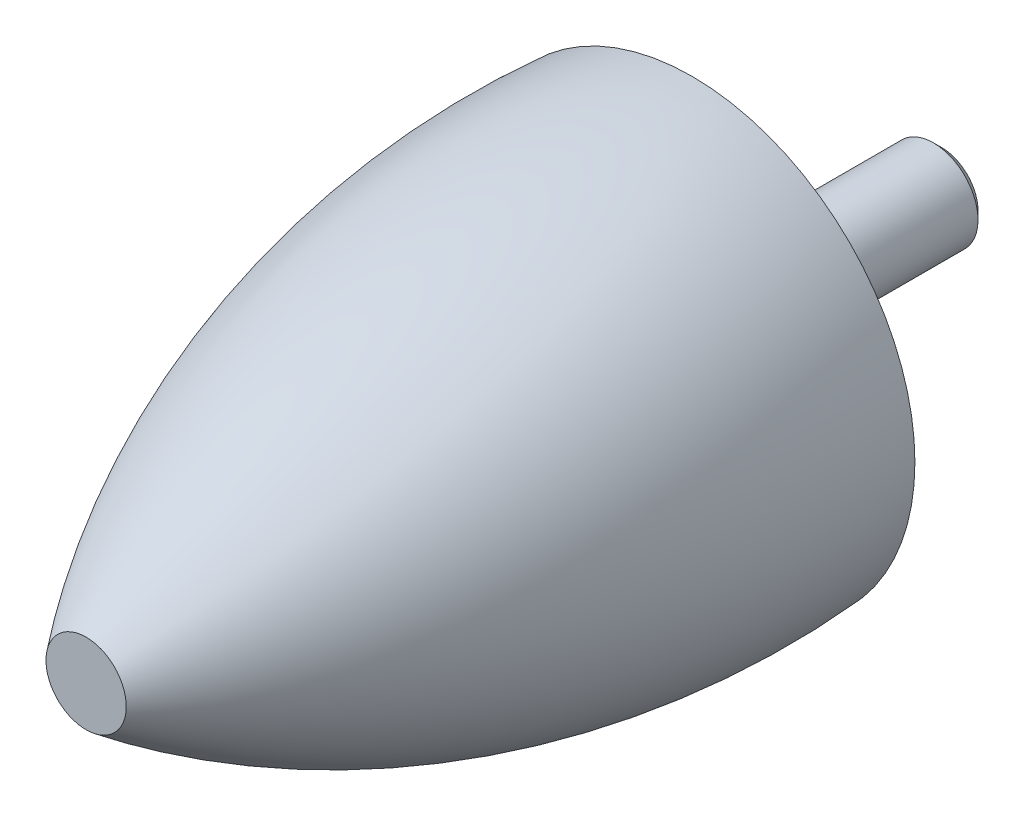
ISO-10303-21;
HEADER;
FILE_DESCRIPTION(('STEP AP214'),'2;1');
FILE_NAME('part.step','',(''),(''),'','','');
FILE_SCHEMA(('AUTOMOTIVE_DESIGN { 1 0 10303 214 1 1 1 1 }'));
ENDSEC;
DATA;
#1=APPLICATION_CONTEXT('core data for automotive mechanical design processes');
#2=APPLICATION_PROTOCOL_DEFINITION('international standard','automotive_design',2000,#1);
#3=PRODUCT_CONTEXT('',#1,'mechanical');
#4=PRODUCT('Part','Part','',(#3));
#5=PRODUCT_RELATED_PRODUCT_CATEGORY('part','',(#4));
#6=PRODUCT_DEFINITION_FORMATION('','',#4);
#7=PRODUCT_DEFINITION_CONTEXT('part definition',#1,'design');
#8=PRODUCT_DEFINITION('design','',#6,#7);
#9=PRODUCT_DEFINITION_SHAPE('','',#8);
#10=(LENGTH_UNIT() NAMED_UNIT(*) SI_UNIT(.MILLI.,.METRE.));
#11=(NAMED_UNIT(*) PLANE_ANGLE_UNIT() SI_UNIT($,.RADIAN.));
#12=(NAMED_UNIT(*) SI_UNIT($,.STERADIAN.) SOLID_ANGLE_UNIT());
#13=UNCERTAINTY_MEASURE_WITH_UNIT(LENGTH_MEASURE(1.E-05),#10,'distance_accuracy_value','');
#14=(GEOMETRIC_REPRESENTATION_CONTEXT(3) GLOBAL_UNCERTAINTY_ASSIGNED_CONTEXT((#13)) GLOBAL_UNIT_ASSIGNED_CONTEXT((#10,
#11,#12)) REPRESENTATION_CONTEXT('',''));
#15=CARTESIAN_POINT('',(0.,0.,0.));
#16=DIRECTION('',(0.,0.,1.));
#17=DIRECTION('',(1.,0.,0.));
#18=AXIS2_PLACEMENT_3D('',#15,#16,#17);
#19=CARTESIAN_POINT('',(25.,0.,0.));
#20=DIRECTION('',(0.,0.,1.));
#21=DIRECTION('',(0.,-1.,0.));
#22=AXIS2_PLACEMENT_3D('',#19,#20,#21);
#23=PLANE('',#22);
#24=CARTESIAN_POINT('',(0.,0.,0.));
#25=DIRECTION('',(0.,0.,-1.));
#26=DIRECTION('',(0.,1.,0.));
#27=AXIS2_PLACEMENT_3D('',#24,#25,#26);
#28=CIRCLE('',#27,5.);
#29=CARTESIAN_POINT('',(0.,5.,0.));
#30=VERTEX_POINT('',#29);
#31=EDGE_CURVE('E23',#30,#30,#28,.T.);
#32=ORIENTED_EDGE('',*,*,#31,.F.);
#33=EDGE_LOOP('',(#32));
#34=FACE_BOUND('',#33,.T.);
#35=CARTESIAN_POINT('',(0.,0.,-1.6826817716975E-13));
#36=DIRECTION('',(0.,0.,-1.));
#37=DIRECTION('',(0.,1.,0.));
#38=AXIS2_PLACEMENT_3D('',#35,#36,#37);
#39=CIRCLE('',#38,25.);
#40=CARTESIAN_POINT('',(0.,25.,-1.6826817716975E-13));
#41=VERTEX_POINT('',#40);
#42=EDGE_CURVE('E19',#41,#41,#39,.T.);
#43=ORIENTED_EDGE('',*,*,#42,.T.);
#44=EDGE_LOOP('',(#43));
#45=FACE_BOUND('',#44,.T.);
#46=ADVANCED_FACE('F12',(#34,#45),#23,.F.);
#47=CARTESIAN_POINT('',(0.,0.,68.));
#48=DIRECTION('',(0.,0.,-1.));
#49=DIRECTION('',(0.,1.,0.));
#50=AXIS2_PLACEMENT_3D('',#47,#48,#49);
#51=PLANE('',#50);
#52=CARTESIAN_POINT('',(0.,0.,68.));
#53=DIRECTION('',(0.,0.,-1.));
#54=DIRECTION('',(0.,1.,0.));
#55=AXIS2_PLACEMENT_3D('',#52,#53,#54);
#56=CIRCLE('',#55,4.5045045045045);
#57=CARTESIAN_POINT('',(0.,4.5045045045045,68.));
#58=VERTEX_POINT('',#57);
#59=EDGE_CURVE('E8',#58,#58,#56,.T.);
#60=ORIENTED_EDGE('',*,*,#59,.F.);
#61=EDGE_LOOP('',(#60));
#62=FACE_BOUND('',#61,.T.);
#63=ADVANCED_FACE('F14',(#62),#51,.F.);
#64=CARTESIAN_POINT('',(0.,0.,7.02269671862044));
#65=DIRECTION('',(0.,0.,-1.));
#66=DIRECTION('',(0.,1.,0.));
#67=AXIS2_PLACEMENT_3D('',#64,#65,#66);
#68=DEGENERATE_TOROIDAL_SURFACE('',#67,74.7531038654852,100.,.F.);
#69=ORIENTED_EDGE('',*,*,#59,.T.);
#70=EDGE_LOOP('',(#69));
#71=FACE_BOUND('',#70,.T.);
#72=ORIENTED_EDGE('',*,*,#42,.F.);
#73=EDGE_LOOP('',(#72));
#74=FACE_BOUND('',#73,.T.);
#75=ADVANCED_FACE('F47',(#71,#74),#68,.F.);
#76=CARTESIAN_POINT('',(0.,0.,-28.));
#77=DIRECTION('',(0.,0.,-1.));
#78=DIRECTION('',(0.,1.,0.));
#79=AXIS2_PLACEMENT_3D('',#76,#77,#78);
#80=CYLINDRICAL_SURFACE('',#79,5.);
#81=CARTESIAN_POINT('',(0.,0.,-27.08));
#82=DIRECTION('',(0.,0.,-1.));
#83=DIRECTION('',(0.,1.,0.));
#84=AXIS2_PLACEMENT_3D('',#81,#82,#83);
#85=CIRCLE('',#84,5.);
#86=CARTESIAN_POINT('',(0.,5.,-27.08));
#87=VERTEX_POINT('',#86);
#88=EDGE_CURVE('E27',#87,#87,#85,.T.);
#89=ORIENTED_EDGE('',*,*,#88,.F.);
#90=EDGE_LOOP('',(#89));
#91=FACE_BOUND('',#90,.T.);
#92=ORIENTED_EDGE('',*,*,#31,.T.);
#93=EDGE_LOOP('',(#92));
#94=FACE_BOUND('',#93,.T.);
#95=ADVANCED_FACE('F41',(#91,#94),#80,.T.);
#96=CARTESIAN_POINT('',(0.,0.,-27.08));
#97=DIRECTION('',(0.,0.,1.));
#98=DIRECTION('',(0.,-1.,0.));
#99=AXIS2_PLACEMENT_3D('',#96,#97,#98);
#100=CONICAL_SURFACE('',#99,5.,0.785398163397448);
#101=CARTESIAN_POINT('',(0.,0.,-28.));
#102=DIRECTION('',(0.,0.,-1.));
#103=DIRECTION('',(0.,1.,0.));
#104=AXIS2_PLACEMENT_3D('',#101,#102,#103);
#105=CIRCLE('',#104,4.08);
#106=CARTESIAN_POINT('',(0.,4.08,-28.));
#107=VERTEX_POINT('',#106);
#108=EDGE_CURVE('E32',#107,#107,#105,.T.);
#109=ORIENTED_EDGE('',*,*,#108,.F.);
#110=EDGE_LOOP('',(#109));
#111=FACE_BOUND('',#110,.T.);
#112=ORIENTED_EDGE('',*,*,#88,.T.);
#113=EDGE_LOOP('',(#112));
#114=FACE_BOUND('',#113,.T.);
#115=ADVANCED_FACE('F38',(#111,#114),#100,.T.);
#116=CARTESIAN_POINT('',(4.08,0.,-28.));
#117=DIRECTION('',(0.,0.,1.));
#118=DIRECTION('',(0.,-1.,0.));
#119=AXIS2_PLACEMENT_3D('',#116,#117,#118);
#120=PLANE('',#119);
#121=ORIENTED_EDGE('',*,*,#108,.T.);
#122=EDGE_LOOP('',(#121));
#123=FACE_BOUND('',#122,.T.);
#124=ADVANCED_FACE('F36',(#123),#120,.F.);
#125=CLOSED_SHELL('',(#46,#63,#75,#95,#115,#124));
#126=MANIFOLD_SOLID_BREP('B1',#125);
#127=ADVANCED_BREP_SHAPE_REPRESENTATION('',(#18,#126),#14);
#128=SHAPE_DEFINITION_REPRESENTATION(#9,#127);
ENDSEC;
END-ISO-10303-21;
